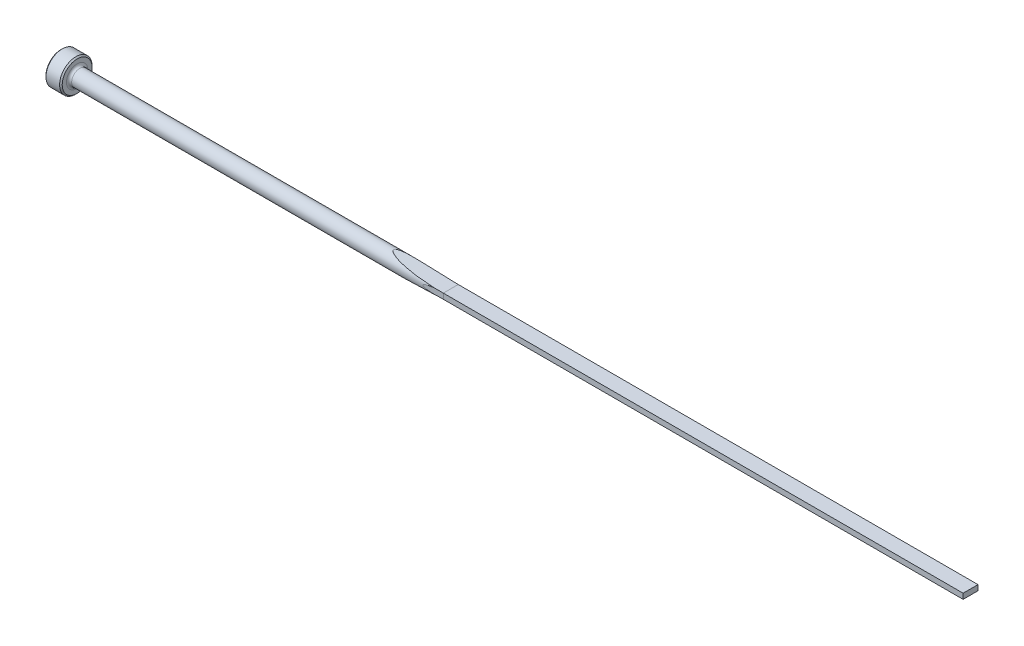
from build123d import *

# Parameters (mm, degrees)
CUT_EXTRUDE1_DEPTH = 267.785031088
CUT_EXTRUDE2_DEPTH = 267.785031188
FILLET1_R          = 0.762
CHAMFER1_SIZE      = 0.381


with BuildPart() as part:
    # Sketch1 → Revolve1 (revolve)
    with BuildSketch(Plane.XY, mode=Mode.PRIVATE) as revolve1_sk:
        Polygon((0, 0), (0, 4.7625), (4.7498, 4.7625), (4.7498, 2.3749), (266.7, 2.3749), (266.7, 0), align=None)
    revolve(revolve1_sk.sketch.rotate(Axis((0, 0, 0), (1, 0, 0)), 90), axis=Axis((0, 0, 0), (1, 0, 0)))

    # Sketch2 → Cut-Extrude1 (cut, symmetric)
    with BuildSketch(Plane.XY):
        with BuildLine():
            Line((266.7, 2.3749), (266.7, 0.7874))
            Line((266.7, 0.7874), (114.3, 0.7874))
            ThreePointArc((114.3, 0.7874), (105.899739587, 1.185164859), (97.574649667, 2.3749))
            Line((97.574649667, 2.3749), (266.7, 2.3749))
        make_face()
    cut_extrude1 = extrude(amount=CUT_EXTRUDE1_DEPTH, both=True, mode=Mode.SUBTRACT)

    # Mirror1: Cut-Extrude1 across plane
    add(cut_extrude1.mirror(Plane.ZX), mode=Mode.SUBTRACT)

    # Sketch3 → Cut-Extrude2 (cut, symmetric)
    with BuildSketch(Plane(origin=(0, 0, 0), x_dir=(1, 0, 0), z_dir=(0, 1, 0))):
        with BuildLine():
            Line((266.7, 2.3749), (266.7, 2.1844))
            Line((266.7, 2.1844), (114.3, 2.1844))
            ThreePointArc((114.3, 2.1844), (111.390064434, 2.232037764), (108.483247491, 2.3749))
            Line((108.483247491, 2.3749), (266.7, 2.3749))
        make_face()
    cut_extrude2 = extrude(amount=CUT_EXTRUDE2_DEPTH, both=True, mode=Mode.SUBTRACT)

    # Mirror2: Cut-Extrude2 across plane
    add(cut_extrude2.mirror(Plane.XY), mode=Mode.SUBTRACT)

    # Fillet1
    fillet1_edges = [part.edges().sort_by_distance(p)[0] for p in [
        (4.7498, 0, -2.3749),
    ]]
    fillet(fillet1_edges, radius=FILLET1_R)

    # Chamfer1
    chamfer1_edges = [part.edges().sort_by_distance(p)[0] for p in [
        (4.7498, 0, -4.7625),
        (0, 0, -4.7625),
    ]]
    chamfer(chamfer1_edges, length=CHAMFER1_SIZE)


solid = part.part
